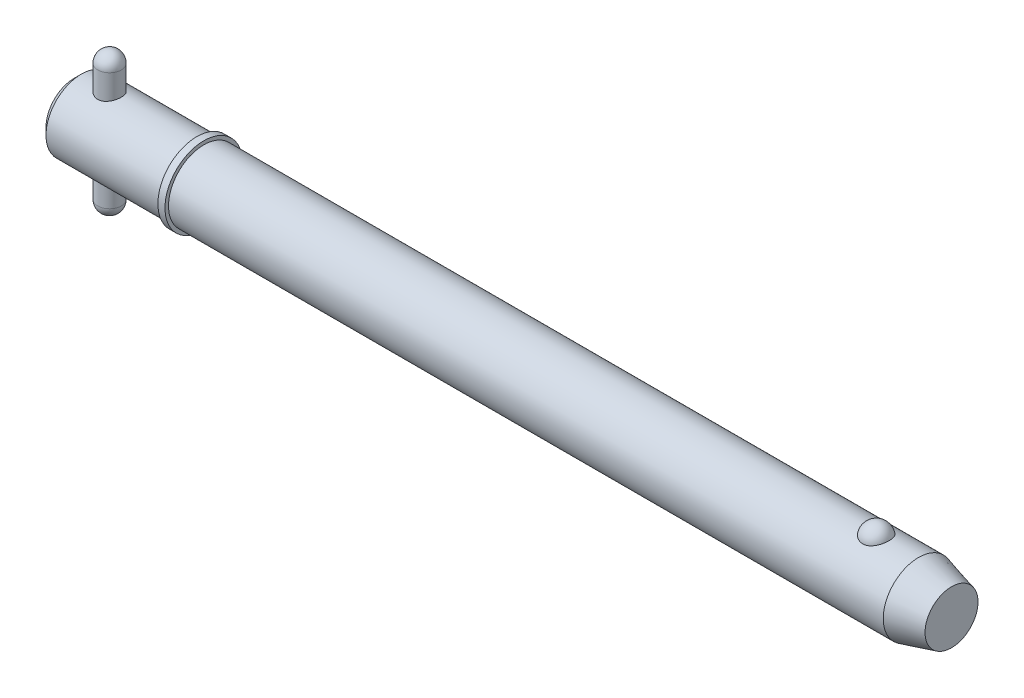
ISO-10303-21;
HEADER;
FILE_DESCRIPTION(('STEP AP214'),'2;1');
FILE_NAME('part.step','',(''),(''),'','','');
FILE_SCHEMA(('AUTOMOTIVE_DESIGN { 1 0 10303 214 1 1 1 1 }'));
ENDSEC;
DATA;
#1=APPLICATION_CONTEXT('core data for automotive mechanical design processes');
#2=APPLICATION_PROTOCOL_DEFINITION('international standard','automotive_design',2000,#1);
#3=PRODUCT_CONTEXT('',#1,'mechanical');
#4=PRODUCT('Part','Part','',(#3));
#5=PRODUCT_RELATED_PRODUCT_CATEGORY('part','',(#4));
#6=PRODUCT_DEFINITION_FORMATION('','',#4);
#7=PRODUCT_DEFINITION_CONTEXT('part definition',#1,'design');
#8=PRODUCT_DEFINITION('design','',#6,#7);
#9=PRODUCT_DEFINITION_SHAPE('','',#8);
#10=(LENGTH_UNIT() NAMED_UNIT(*) SI_UNIT(.MILLI.,.METRE.));
#11=(NAMED_UNIT(*) PLANE_ANGLE_UNIT() SI_UNIT($,.RADIAN.));
#12=(NAMED_UNIT(*) SI_UNIT($,.STERADIAN.) SOLID_ANGLE_UNIT());
#13=UNCERTAINTY_MEASURE_WITH_UNIT(LENGTH_MEASURE(1.E-05),#10,'distance_accuracy_value','');
#14=(GEOMETRIC_REPRESENTATION_CONTEXT(3) GLOBAL_UNCERTAINTY_ASSIGNED_CONTEXT((#13)) GLOBAL_UNIT_ASSIGNED_CONTEXT((#10,
#11,#12)) REPRESENTATION_CONTEXT('',''));
#15=CARTESIAN_POINT('',(0.,0.,0.));
#16=DIRECTION('',(0.,0.,1.));
#17=DIRECTION('',(1.,0.,0.));
#18=AXIS2_PLACEMENT_3D('',#15,#16,#17);
#19=CARTESIAN_POINT('',(9.525,19.05,0.));
#20=DIRECTION('',(0.,-1.,0.));
#21=DIRECTION('',(0.,0.,-1.));
#22=AXIS2_PLACEMENT_3D('',#19,#20,#21);
#23=CYLINDRICAL_SURFACE('',#22,3.175);
#24=CARTESIAN_POINT('',(9.525,-15.875,0.));
#25=DIRECTION('',(0.,-1.,0.));
#26=DIRECTION('',(0.,0.,-1.));
#27=AXIS2_PLACEMENT_3D('',#24,#25,#26);
#28=CIRCLE('',#27,3.175);
#29=CARTESIAN_POINT('',(9.525,-15.875,-3.175));
#30=VERTEX_POINT('',#29);
#31=EDGE_CURVE('P0_E10',#30,#30,#28,.F.);
#32=CARTESIAN_POINT('',(9.525,15.875,0.));
#33=DIRECTION('',(0.,-1.,0.));
#34=DIRECTION('',(0.,0.,-1.));
#35=AXIS2_PLACEMENT_3D('',#32,#33,#34);
#36=CIRCLE('',#35,3.175);
#37=CARTESIAN_POINT('',(9.525,15.875,-3.175));
#38=VERTEX_POINT('',#37);
#39=EDGE_CURVE('P0_E21',#38,#38,#36,.T.);
#40=CARTESIAN_POINT('',(9.525,-15.875,-3.175));
#41=CARTESIAN_POINT('',(9.525,-15.5442708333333,-3.175));
#42=CARTESIAN_POINT('',(9.525,-15.2135416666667,-3.175));
#43=CARTESIAN_POINT('',(9.525,-14.5520833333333,-3.175));
#44=CARTESIAN_POINT('',(9.525,-14.2213541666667,-3.175));
#45=CARTESIAN_POINT('',(9.525,-13.5598958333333,-3.175));
#46=CARTESIAN_POINT('',(9.525,-13.2291666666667,-3.175));
#47=CARTESIAN_POINT('',(9.525,-12.5677083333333,-3.175));
#48=CARTESIAN_POINT('',(9.525,-12.2369791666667,-3.175));
#49=CARTESIAN_POINT('',(9.525,-11.5755208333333,-3.175));
#50=CARTESIAN_POINT('',(9.525,-11.2447916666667,-3.175));
#51=CARTESIAN_POINT('',(9.525,-10.5833333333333,-3.175));
#52=CARTESIAN_POINT('',(9.525,-10.2526041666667,-3.175));
#53=CARTESIAN_POINT('',(9.525,-9.59114583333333,-3.175));
#54=CARTESIAN_POINT('',(9.525,-9.26041666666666,-3.175));
#55=CARTESIAN_POINT('',(9.525,-8.59895833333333,-3.175));
#56=CARTESIAN_POINT('',(9.525,-8.26822916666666,-3.175));
#57=CARTESIAN_POINT('',(9.525,-7.60677083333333,-3.175));
#58=CARTESIAN_POINT('',(9.525,-7.27604166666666,-3.175));
#59=CARTESIAN_POINT('',(9.525,-6.61458333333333,-3.175));
#60=CARTESIAN_POINT('',(9.525,-6.28385416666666,-3.175));
#61=CARTESIAN_POINT('',(9.525,-5.62239583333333,-3.175));
#62=CARTESIAN_POINT('',(9.525,-5.29166666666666,-3.175));
#63=CARTESIAN_POINT('',(9.525,-4.63020833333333,-3.175));
#64=CARTESIAN_POINT('',(9.525,-4.29947916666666,-3.175));
#65=CARTESIAN_POINT('',(9.525,-3.63802083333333,-3.175));
#66=CARTESIAN_POINT('',(9.525,-3.30729166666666,-3.175));
#67=CARTESIAN_POINT('',(9.525,-2.64583333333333,-3.175));
#68=CARTESIAN_POINT('',(9.525,-2.31510416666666,-3.175));
#69=CARTESIAN_POINT('',(9.525,-1.65364583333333,-3.175));
#70=CARTESIAN_POINT('',(9.525,-1.32291666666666,-3.175));
#71=CARTESIAN_POINT('',(9.525,-0.661458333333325,-3.175));
#72=CARTESIAN_POINT('',(9.525,-0.330729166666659,-3.175));
#73=CARTESIAN_POINT('',(9.525,0.330729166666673,-3.175));
#74=CARTESIAN_POINT('',(9.525,0.661458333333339,-3.175));
#75=CARTESIAN_POINT('',(9.525,1.32291666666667,-3.175));
#76=CARTESIAN_POINT('',(9.525,1.65364583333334,-3.175));
#77=CARTESIAN_POINT('',(9.525,2.31510416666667,-3.175));
#78=CARTESIAN_POINT('',(9.525,2.64583333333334,-3.175));
#79=CARTESIAN_POINT('',(9.525,3.30729166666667,-3.175));
#80=CARTESIAN_POINT('',(9.525,3.63802083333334,-3.175));
#81=CARTESIAN_POINT('',(9.525,4.29947916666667,-3.175));
#82=CARTESIAN_POINT('',(9.525,4.63020833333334,-3.175));
#83=CARTESIAN_POINT('',(9.525,5.29166666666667,-3.175));
#84=CARTESIAN_POINT('',(9.525,5.62239583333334,-3.175));
#85=CARTESIAN_POINT('',(9.525,6.28385416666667,-3.175));
#86=CARTESIAN_POINT('',(9.525,6.61458333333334,-3.175));
#87=CARTESIAN_POINT('',(9.525,7.27604166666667,-3.175));
#88=CARTESIAN_POINT('',(9.525,7.60677083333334,-3.175));
#89=CARTESIAN_POINT('',(9.525,8.26822916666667,-3.175));
#90=CARTESIAN_POINT('',(9.525,8.59895833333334,-3.175));
#91=CARTESIAN_POINT('',(9.525,9.26041666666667,-3.175));
#92=CARTESIAN_POINT('',(9.525,9.59114583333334,-3.175));
#93=CARTESIAN_POINT('',(9.525,10.2526041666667,-3.175));
#94=CARTESIAN_POINT('',(9.525,10.5833333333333,-3.175));
#95=CARTESIAN_POINT('',(9.525,11.2447916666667,-3.175));
#96=CARTESIAN_POINT('',(9.525,11.5755208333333,-3.175));
#97=CARTESIAN_POINT('',(9.525,12.2369791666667,-3.175));
#98=CARTESIAN_POINT('',(9.525,12.5677083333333,-3.175));
#99=CARTESIAN_POINT('',(9.525,13.2291666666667,-3.175));
#100=CARTESIAN_POINT('',(9.525,13.5598958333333,-3.175));
#101=CARTESIAN_POINT('',(9.525,14.2213541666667,-3.175));
#102=CARTESIAN_POINT('',(9.525,14.5520833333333,-3.175));
#103=CARTESIAN_POINT('',(9.525,15.2135416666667,-3.175));
#104=CARTESIAN_POINT('',(9.525,15.5442708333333,-3.175));
#105=CARTESIAN_POINT('',(9.525,15.875,-3.175));
#106=B_SPLINE_CURVE_WITH_KNOTS('',3,(#40,#41,#42,#43,#44,#45,#46,#47,#48,#49,#50,#51,#52,#53,
#54,#55,#56,#57,#58,#59,#60,#61,#62,#63,#64,#65,#66,#67,#68,#69,#70,#71,#72,#73,#74,#75,#76,#77,
#78,#79,#80,#81,#82,#83,#84,#85,#86,#87,#88,#89,#90,#91,#92,#93,#94,#95,#96,#97,#98,#99,#100,
#101,#102,#103,#104,#105),.UNSPECIFIED.,.F.,.F.,(4,2,2,2,2,2,2,2,2,2,2,2,2,2,2,2,2,2,2,2,2,2,2,
2,2,2,2,2,2,2,2,2,4),(0.,0.992187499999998,1.984375,2.9765625,3.96875,4.96093749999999,5.953125,
6.9453125,7.9375,8.92968749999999,9.921875,10.9140625,11.90625,12.8984375,13.890625,14.8828125,
15.875,16.8671875,17.859375,18.8515625,19.84375,20.8359375,21.828125,22.8203125,23.8125,
24.8046875,25.796875,26.7890625,27.78125,28.7734375,29.765625,30.7578125,31.75),.UNSPECIFIED.);
#107=EDGE_CURVE('P0_BSEAM14',#30,#38,#106,.T.);
#108=ORIENTED_EDGE('',*,*,#31,.T.);
#109=ORIENTED_EDGE('',*,*,#39,.T.);
#110=ORIENTED_EDGE('',*,*,#107,.T.);
#111=ORIENTED_EDGE('',*,*,#107,.F.);
#112=EDGE_LOOP('',(#108,#110,#109,#111));
#113=FACE_BOUND('',#112,.T.);
#114=ADVANCED_FACE('P0_F14',(#113),#23,.T.);
#115=CARTESIAN_POINT('',(9.525,-15.875,0.));
#116=DIRECTION('',(0.,0.,1.));
#117=DIRECTION('',(1.,0.,0.));
#118=AXIS2_PLACEMENT_3D('',#115,#116,#117);
#119=SPHERICAL_SURFACE('',#118,3.175);
#120=CARTESIAN_POINT('',(9.525,-15.875,0.));
#121=DIRECTION('',(0.,-1.,0.));
#122=DIRECTION('',(0.,0.,-1.));
#123=AXIS2_PLACEMENT_3D('',#120,#121,#122);
#124=SPHERICAL_SURFACE('',#123,3.175);
#125=ORIENTED_EDGE('',*,*,#31,.F.);
#126=EDGE_LOOP('',(#125));
#127=FACE_BOUND('',#126,.T.);
#128=ADVANCED_FACE('P0_F29',(#127),#124,.T.);
#129=CARTESIAN_POINT('',(9.525,15.875,0.));
#130=DIRECTION('',(0.,0.,1.));
#131=DIRECTION('',(1.,0.,0.));
#132=AXIS2_PLACEMENT_3D('',#129,#130,#131);
#133=SPHERICAL_SURFACE('',#132,3.175);
#134=CARTESIAN_POINT('',(9.525,15.875,0.));
#135=DIRECTION('',(0.,-1.,0.));
#136=DIRECTION('',(0.,0.,-1.));
#137=AXIS2_PLACEMENT_3D('',#134,#135,#136);
#138=SPHERICAL_SURFACE('',#137,3.175);
#139=ORIENTED_EDGE('',*,*,#39,.F.);
#140=EDGE_LOOP('',(#139));
#141=FACE_BOUND('',#140,.T.);
#142=ADVANCED_FACE('P0_F16',(#141),#138,.T.);
#143=CLOSED_SHELL('',(#114,#128,#142));
#144=MANIFOLD_SOLID_BREP('P0_B1',#143);
#145=CARTESIAN_POINT('',(0.,0.,0.));
#146=DIRECTION('',(1.,0.,0.));
#147=DIRECTION('',(0.,0.,-1.));
#148=AXIS2_PLACEMENT_3D('',#145,#146,#147);
#149=CYLINDRICAL_SURFACE('',#148,9.525);
#150=CARTESIAN_POINT('',(227.643054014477,0.,0.));
#151=DIRECTION('',(1.,0.,0.));
#152=DIRECTION('',(0.,0.,-1.));
#153=AXIS2_PLACEMENT_3D('',#150,#151,#152);
#154=CIRCLE('',#153,9.525);
#155=CARTESIAN_POINT('',(227.643054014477,0.,-9.525));
#156=VERTEX_POINT('',#155);
#157=EDGE_CURVE('P1_E81',#156,#156,#154,.T.);
#158=ORIENTED_EDGE('',*,*,#157,.F.);
#159=EDGE_LOOP('',(#158));
#160=FACE_BOUND('',#159,.T.);
#161=CARTESIAN_POINT('',(34.93,0.,0.));
#162=DIRECTION('',(1.,0.,0.));
#163=DIRECTION('',(0.,0.,-1.));
#164=AXIS2_PLACEMENT_3D('',#161,#162,#163);
#165=CIRCLE('',#164,9.525);
#166=CARTESIAN_POINT('',(34.93,0.,-9.525));
#167=VERTEX_POINT('',#166);
#168=EDGE_CURVE('P1_E85',#167,#167,#165,.T.);
#169=ORIENTED_EDGE('',*,*,#168,.T.);
#170=EDGE_LOOP('',(#169));
#171=FACE_BOUND('',#170,.T.);
#172=CARTESIAN_POINT('',(216.245757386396,8.80405803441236,3.63513233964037));
#173=CARTESIAN_POINT('',(216.151676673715,8.80405953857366,3.63513053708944));
#174=CARTESIAN_POINT('',(216.057561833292,8.80561325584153,3.63137461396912));
#175=CARTESIAN_POINT('',(215.870012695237,8.81177748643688,3.616386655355));
#176=CARTESIAN_POINT('',(215.776578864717,8.81638992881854,3.60514990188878));
#177=CARTESIAN_POINT('',(215.497945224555,8.83467114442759,3.56024627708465));
#178=CARTESIAN_POINT('',(215.314691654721,8.85278327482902,3.51538626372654));
#179=CARTESIAN_POINT('',(214.959509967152,8.89871214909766,3.39742145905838));
#180=CARTESIAN_POINT('',(214.787553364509,8.9265032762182,3.32439116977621));
#181=CARTESIAN_POINT('',(214.458707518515,8.98874819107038,3.15220244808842));
#182=CARTESIAN_POINT('',(214.301811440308,9.02319893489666,3.053055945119));
#183=CARTESIAN_POINT('',(214.002214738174,9.0962918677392,2.82797815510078));
#184=CARTESIAN_POINT('',(213.860060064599,9.13502685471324,2.70135138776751));
#185=CARTESIAN_POINT('',(213.598299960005,9.21186572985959,2.42641932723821));
#186=CARTESIAN_POINT('',(213.478701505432,9.2499694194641,2.27810735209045));
#187=CARTESIAN_POINT('',(213.259645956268,9.3234108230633,1.95652290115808));
#188=CARTESIAN_POINT('',(213.161317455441,9.35855090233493,1.78243511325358));
#189=CARTESIAN_POINT('',(212.993819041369,9.42045142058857,1.41937246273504));
#190=CARTESIAN_POINT('',(212.924651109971,9.44721128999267,1.23039658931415));
#191=CARTESIAN_POINT('',(212.816199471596,9.48990641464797,0.840370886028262));
#192=CARTESIAN_POINT('',(212.777288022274,9.50570658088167,0.639202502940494));
#193=CARTESIAN_POINT('',(212.731555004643,9.52433146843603,0.232664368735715));
#194=CARTESIAN_POINT('',(212.724732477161,9.52715657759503,0.0272947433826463));
#195=CARTESIAN_POINT('',(212.743255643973,9.51956918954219,-0.380478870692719));
#196=CARTESIAN_POINT('',(212.768405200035,9.50923740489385,-0.582893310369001));
#197=CARTESIAN_POINT('',(212.85002537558,9.47651897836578,-0.980293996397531));
#198=CARTESIAN_POINT('',(212.906496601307,9.45413210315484,-1.17528009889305));
#199=CARTESIAN_POINT('',(213.049719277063,9.39954044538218,-1.55263697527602));
#200=CARTESIAN_POINT('',(213.136512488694,9.36732213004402,-1.73498993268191));
#201=CARTESIAN_POINT('',(213.338610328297,9.29640700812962,-2.08177763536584));
#202=CARTESIAN_POINT('',(213.453917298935,9.25770966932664,-2.24621090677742));
#203=CARTESIAN_POINT('',(213.711264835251,9.17775604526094,-2.5533833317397));
#204=CARTESIAN_POINT('',(213.853434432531,9.136488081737,-2.69601150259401));
#205=CARTESIAN_POINT('',(214.16089985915,9.05620497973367,-2.95451229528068));
#206=CARTESIAN_POINT('',(214.326193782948,9.01718965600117,-3.07038711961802));
#207=CARTESIAN_POINT('',(214.672052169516,8.9468001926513,-3.26976836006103));
#208=CARTESIAN_POINT('',(214.852227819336,8.91528408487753,-3.35389750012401));
#209=CARTESIAN_POINT('',(215.225651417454,8.86272514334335,-3.49043503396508));
#210=CARTESIAN_POINT('',(215.418894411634,8.8416783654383,-3.54285537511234));
#211=CARTESIAN_POINT('',(215.802503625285,8.81348056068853,-3.61241306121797));
#212=CARTESIAN_POINT('',(215.992525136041,8.80568348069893,-3.63119339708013));
#213=CARTESIAN_POINT('',(216.373190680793,8.80289410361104,-3.6379534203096));
#214=CARTESIAN_POINT('',(216.563834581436,8.8078992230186,-3.6259393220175));
#215=CARTESIAN_POINT('',(216.934007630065,8.82974915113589,-3.57238430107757));
#216=CARTESIAN_POINT('',(217.113697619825,8.84621463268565,-3.53178890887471));
#217=CARTESIAN_POINT('',(217.463422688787,8.88875330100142,-3.42331083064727));
#218=CARTESIAN_POINT('',(217.633456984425,8.91482726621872,-3.35542593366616));
#219=CARTESIAN_POINT('',(217.963237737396,8.97448239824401,-3.19248225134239));
#220=CARTESIAN_POINT('',(218.122680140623,9.00821446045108,-3.09686474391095));
#221=CARTESIAN_POINT('',(218.423513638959,9.0793539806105,-2.88162736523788));
#222=CARTESIAN_POINT('',(218.564900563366,9.1167622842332,-2.7620019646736));
#223=CARTESIAN_POINT('',(218.83331931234,9.19347419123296,-2.49516285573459));
#224=CARTESIAN_POINT('',(218.959275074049,9.23277872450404,-2.34686614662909));
#225=CARTESIAN_POINT('',(219.185522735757,9.30737610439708,-2.03093683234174));
#226=CARTESIAN_POINT('',(219.28581004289,9.34266823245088,-1.86330077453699));
#227=CARTESIAN_POINT('',(219.461514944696,9.40674710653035,-1.50744893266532));
#228=CARTESIAN_POINT('',(219.536041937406,9.4352917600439,-1.31874876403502));
#229=CARTESIAN_POINT('',(219.65416505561,9.4814413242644,-0.930631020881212));
#230=CARTESIAN_POINT('',(219.697760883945,9.49904612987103,-0.73121334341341));
#231=CARTESIAN_POINT('',(219.753158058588,9.5215314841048,-0.327147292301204));
#232=CARTESIAN_POINT('',(219.764935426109,9.52640243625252,-0.122495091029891));
#233=CARTESIAN_POINT('',(219.756382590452,9.52289571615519,0.286018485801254));
#234=CARTESIAN_POINT('',(219.73605305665,9.51451832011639,0.489879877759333));
#235=CARTESIAN_POINT('',(219.663884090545,9.48544083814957,0.889994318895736));
#236=CARTESIAN_POINT('',(219.612199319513,9.46480124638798,1.08627971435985));
#237=CARTESIAN_POINT('',(219.478491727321,9.4133389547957,1.46682086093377));
#238=CARTESIAN_POINT('',(219.396466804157,9.38251554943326,1.65107577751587));
#239=CARTESIAN_POINT('',(219.20319292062,9.31365636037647,2.00346348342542));
#240=CARTESIAN_POINT('',(219.091783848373,9.27558138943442,2.17150083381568));
#241=CARTESIAN_POINT('',(218.842294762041,9.19638714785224,2.48563115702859));
#242=CARTESIAN_POINT('',(218.704216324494,9.15526805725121,2.63172542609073));
#243=CARTESIAN_POINT('',(218.404843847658,9.07465393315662,2.89750997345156));
#244=CARTESIAN_POINT('',(218.243610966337,9.03515496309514,3.01726776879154));
#245=CARTESIAN_POINT('',(217.901613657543,8.96227564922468,3.22732920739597));
#246=CARTESIAN_POINT('',(217.720841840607,8.92889763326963,3.31762165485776));
#247=CARTESIAN_POINT('',(217.351445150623,8.87345380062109,3.46314419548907));
#248=CARTESIAN_POINT('',(217.16332371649,8.85102983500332,3.51950082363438));
#249=CARTESIAN_POINT('',(216.87578699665,8.82666967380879,3.57993683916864));
#250=CARTESIAN_POINT('',(216.779133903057,8.82009725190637,3.59606217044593));
#251=CARTESIAN_POINT('',(216.584677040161,8.81020897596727,3.62022512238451));
#252=CARTESIAN_POINT('',(216.48687410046,8.80689090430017,3.62826825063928));
#253=CARTESIAN_POINT('',(216.341224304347,8.80445615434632,3.63416760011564));
#254=CARTESIAN_POINT('',(216.293495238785,8.80405727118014,3.63513325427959));
#255=CARTESIAN_POINT('',(216.245757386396,8.80405803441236,3.63513233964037));
#256=B_SPLINE_CURVE_WITH_KNOTS('',3,(#172,#173,#174,#175,#176,#177,#178,#179,#180,#181,#182,
#183,#184,#185,#186,#187,#188,#189,#190,#191,#192,#193,#194,#195,#196,#197,#198,#199,#200,#201,
#202,#203,#204,#205,#206,#207,#208,#209,#210,#211,#212,#213,#214,#215,#216,#217,#218,#219,#220,
#221,#222,#223,#224,#225,#226,#227,#228,#229,#230,#231,#232,#233,#234,#235,#236,#237,#238,#239,
#240,#241,#242,#243,#244,#245,#246,#247,#248,#249,#250,#251,#252,#253,#254,#255),.UNSPECIFIED.,
.T.,.F.,(4,2,2,2,2,2,2,2,2,2,2,2,2,2,2,2,2,2,2,2,2,2,2,2,2,2,2,2,2,2,2,2,2,2,2,2,2,2,2,2,2,4),
(0.,0.282202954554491,0.564584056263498,1.13017050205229,1.69427128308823,2.25811483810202,
2.83836627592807,3.41879688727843,4.02497117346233,4.63118665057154,5.24474754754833,
5.85829010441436,6.46808687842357,7.07789545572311,7.68854723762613,8.29924920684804,
8.91296283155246,9.52662591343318,10.1275338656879,10.7282152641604,11.2986646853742,
11.868998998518,12.4213015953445,12.9736489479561,13.5380053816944,14.1024919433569,
14.6952986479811,15.2882113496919,15.8999469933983,16.5116885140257,17.1238909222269,
17.7360805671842,18.3452748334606,18.9545113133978,19.5671386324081,20.1797297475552,
20.7907316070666,21.4019653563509,21.9915938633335,22.2859053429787,22.580016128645,
22.7232098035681),.UNSPECIFIED.);
#257=CARTESIAN_POINT('',(216.245757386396,8.80405803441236,3.63513233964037));
#258=VERTEX_POINT('',#257);
#259=EDGE_CURVE('P1_E35',#258,#258,#256,.T.);
#260=ORIENTED_EDGE('',*,*,#259,.T.);
#261=EDGE_LOOP('',(#260));
#262=FACE_BOUND('',#261,.T.);
#263=ADVANCED_FACE('P1_F13',(#160,#171,#262),#149,.T.);
#264=CARTESIAN_POINT('',(0.,0.,0.));
#265=DIRECTION('',(-1.,0.,0.));
#266=DIRECTION('',(0.,0.,1.));
#267=AXIS2_PLACEMENT_3D('',#264,#265,#266);
#268=PLANE('',#267);
#269=CARTESIAN_POINT('',(0.,0.,0.));
#270=DIRECTION('',(1.,0.,0.));
#271=DIRECTION('',(0.,0.,-1.));
#272=AXIS2_PLACEMENT_3D('',#269,#270,#271);
#273=CIRCLE('',#272,7.62);
#274=CARTESIAN_POINT('',(0.,0.,-7.62));
#275=VERTEX_POINT('',#274);
#276=EDGE_CURVE('P1_E9',#275,#275,#273,.T.);
#277=ORIENTED_EDGE('',*,*,#276,.F.);
#278=EDGE_LOOP('',(#277));
#279=FACE_BOUND('',#278,.T.);
#280=ADVANCED_FACE('P1_F15',(#279),#268,.T.);
#281=CARTESIAN_POINT('',(1.90499999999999,0.,0.));
#282=DIRECTION('',(1.,0.,0.));
#283=DIRECTION('',(0.,0.,-1.));
#284=AXIS2_PLACEMENT_3D('',#281,#282,#283);
#285=CONICAL_SURFACE('',#284,9.525,0.785398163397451);
#286=ORIENTED_EDGE('',*,*,#276,.T.);
#287=EDGE_LOOP('',(#286));
#288=FACE_BOUND('',#287,.T.);
#289=CARTESIAN_POINT('',(1.90499999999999,0.,0.));
#290=DIRECTION('',(1.,0.,0.));
#291=DIRECTION('',(0.,0.,-1.));
#292=AXIS2_PLACEMENT_3D('',#289,#290,#291);
#293=CIRCLE('',#292,9.525);
#294=CARTESIAN_POINT('',(1.90499999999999,0.,-9.525));
#295=VERTEX_POINT('',#294);
#296=EDGE_CURVE('P1_E26',#295,#295,#293,.T.);
#297=ORIENTED_EDGE('',*,*,#296,.F.);
#298=EDGE_LOOP('',(#297));
#299=FACE_BOUND('',#298,.T.);
#300=ADVANCED_FACE('P1_F77',(#288,#299),#285,.T.);
#301=CARTESIAN_POINT('',(0.,0.,0.));
#302=DIRECTION('',(1.,0.,0.));
#303=DIRECTION('',(0.,0.,-1.));
#304=AXIS2_PLACEMENT_3D('',#301,#302,#303);
#305=CYLINDRICAL_SURFACE('',#304,9.525);
#306=CARTESIAN_POINT('',(9.525,-8.98025612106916,3.175));
#307=CARTESIAN_POINT('',(9.35206354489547,-8.98025555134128,3.17500081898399));
#308=CARTESIAN_POINT('',(9.17913201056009,-8.98530617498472,3.16082293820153));
#309=CARTESIAN_POINT('',(8.83839221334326,-9.00485797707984,3.10467734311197));
#310=CARTESIAN_POINT('',(8.67058479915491,-9.0193607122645,3.06270505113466));
#311=CARTESIAN_POINT('',(8.34508461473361,-9.05599546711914,2.95260866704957));
#312=CARTESIAN_POINT('',(8.18737272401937,-9.07811252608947,2.88453582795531));
#313=CARTESIAN_POINT('',(7.88555684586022,-9.12746212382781,2.72434567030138));
#314=CARTESIAN_POINT('',(7.74145587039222,-9.1546957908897,2.63222304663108));
#315=CARTESIAN_POINT('',(7.46531411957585,-9.21240503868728,2.42268738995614));
#316=CARTESIAN_POINT('',(7.33388351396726,-9.24296141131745,2.30449228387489));
#317=CARTESIAN_POINT('',(7.09229340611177,-9.30319020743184,2.0478358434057));
#318=CARTESIAN_POINT('',(6.98213731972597,-9.33286248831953,1.90937126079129));
#319=CARTESIAN_POINT('',(6.78345450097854,-9.38891527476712,1.61164431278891));
#320=CARTESIAN_POINT('',(6.69556709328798,-9.41518969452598,1.45193356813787));
#321=CARTESIAN_POINT('',(6.54814671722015,-9.46053437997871,1.11896913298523));
#322=CARTESIAN_POINT('',(6.48860610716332,-9.47960658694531,0.945719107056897));
#323=CARTESIAN_POINT('',(6.40163866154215,-9.50782564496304,0.596991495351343));
#324=CARTESIAN_POINT('',(6.373166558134,-9.5172947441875,0.421801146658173));
#325=CARTESIAN_POINT('',(6.3458207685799,-9.52638456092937,0.068890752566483));
#326=CARTESIAN_POINT('',(6.34693945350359,-9.52600781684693,-0.108828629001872));
#327=CARTESIAN_POINT('',(6.37808050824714,-9.51566675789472,-0.454353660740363));
#328=CARTESIAN_POINT('',(6.4069675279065,-9.50607905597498,-0.622274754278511));
#329=CARTESIAN_POINT('',(6.490947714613,-9.47886621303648,-0.950732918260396));
#330=CARTESIAN_POINT('',(6.54604265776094,-9.46124052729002,-1.11126948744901));
#331=CARTESIAN_POINT('',(6.68153768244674,-9.41945253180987,-1.42288410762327));
#332=CARTESIAN_POINT('',(6.76226085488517,-9.3952073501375,-1.57381010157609));
#333=CARTESIAN_POINT('',(6.94645456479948,-9.34270397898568,-1.86030973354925));
#334=CARTESIAN_POINT('',(7.04993142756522,-9.31444467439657,-1.99587908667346));
#335=CARTESIAN_POINT('',(7.28241619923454,-9.25532159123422,-2.2545702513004));
#336=CARTESIAN_POINT('',(7.4123967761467,-9.22439783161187,-2.37680549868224));
#337=CARTESIAN_POINT('',(7.69127470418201,-9.1645528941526,-2.5980302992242));
#338=CARTESIAN_POINT('',(7.84017496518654,-9.13563202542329,-2.6970162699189));
#339=CARTESIAN_POINT('',(8.15547526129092,-9.08273917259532,-2.87016016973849));
#340=CARTESIAN_POINT('',(8.32209451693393,-9.05884361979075,-2.94394402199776));
#341=CARTESIAN_POINT('',(8.66638917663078,-9.01959241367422,-3.06210713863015));
#342=CARTESIAN_POINT('',(8.84405991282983,-9.00423318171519,-3.10649872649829));
#343=CARTESIAN_POINT('',(9.19682677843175,-8.98460345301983,-3.16281207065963));
#344=CARTESIAN_POINT('',(9.37167742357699,-8.9798639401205,-3.17610837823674));
#345=CARTESIAN_POINT('',(9.72113927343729,-8.9806993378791,-3.17374726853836));
#346=CARTESIAN_POINT('',(9.89575051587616,-8.98627237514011,-3.15809511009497));
#347=CARTESIAN_POINT('',(10.2335233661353,-9.00663737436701,-3.09951644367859));
#348=CARTESIAN_POINT('',(10.3968722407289,-9.02110608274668,-3.05754530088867));
#349=CARTESIAN_POINT('',(10.7141759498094,-9.05727657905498,-2.94866651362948));
#350=CARTESIAN_POINT('',(10.8681291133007,-9.07897964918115,-2.88175444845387));
#351=CARTESIAN_POINT('',(11.1676828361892,-9.12802586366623,-2.72248103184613));
#352=CARTESIAN_POINT('',(11.3128635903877,-9.1555260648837,-2.62937980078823));
#353=CARTESIAN_POINT('',(11.5860387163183,-9.21276315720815,-2.42120937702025));
#354=CARTESIAN_POINT('',(11.7140280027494,-9.24250070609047,-2.30613370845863));
#355=CARTESIAN_POINT('',(11.9555513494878,-9.30259247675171,-2.05070616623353));
#356=CARTESIAN_POINT('',(12.0680936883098,-9.33290753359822,-1.90940458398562));
#357=CARTESIAN_POINT('',(12.267933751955,-9.3893275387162,-1.60917665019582));
#358=CARTESIAN_POINT('',(12.3552323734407,-9.41543263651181,-1.45025092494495));
#359=CARTESIAN_POINT('',(12.5013088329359,-9.46036988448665,-1.12007606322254));
#360=CARTESIAN_POINT('',(12.5602723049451,-9.47924920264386,-0.9489158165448));
#361=CARTESIAN_POINT('',(12.6483355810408,-9.50781089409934,-0.598355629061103));
#362=CARTESIAN_POINT('',(12.6774461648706,-9.5174965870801,-0.4189586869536));
#363=CARTESIAN_POINT('',(12.7040070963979,-9.52632915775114,-0.066088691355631));
#364=CARTESIAN_POINT('',(12.7028811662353,-9.52594996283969,0.107266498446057));
#365=CARTESIAN_POINT('',(12.6725130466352,-9.51586223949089,0.451202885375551));
#366=CARTESIAN_POINT('',(12.643273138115,-9.50615446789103,0.621784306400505));
#367=CARTESIAN_POINT('',(12.5584514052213,-9.47867404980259,0.952633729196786));
#368=CARTESIAN_POINT('',(12.5032953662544,-9.46103195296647,1.1130225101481));
#369=CARTESIAN_POINT('',(12.3686013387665,-9.41949985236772,1.42233126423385));
#370=CARTESIAN_POINT('',(12.2890589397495,-9.39560871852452,1.57124915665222));
#371=CARTESIAN_POINT('',(12.1044667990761,-9.34294133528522,1.85938800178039));
#372=CARTESIAN_POINT('',(11.9985831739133,-9.31401720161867,1.9980473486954));
#373=CARTESIAN_POINT('',(11.7657327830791,-9.25490239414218,2.25609475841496));
#374=CARTESIAN_POINT('',(11.6387592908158,-9.22471131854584,2.37547664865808));
#375=CARTESIAN_POINT('',(11.3613902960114,-9.16505913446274,2.59633024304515));
#376=CARTESIAN_POINT('',(11.2102725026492,-9.13567286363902,2.69691791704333));
#377=CARTESIAN_POINT('',(10.8923631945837,-9.08241113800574,2.87119803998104));
#378=CARTESIAN_POINT('',(10.7255757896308,-9.05853424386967,2.94489751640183));
#379=CARTESIAN_POINT('',(10.3887212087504,-9.02021736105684,3.06020415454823));
#380=CARTESIAN_POINT('',(10.219143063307,-9.00539959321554,3.10311136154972));
#381=CARTESIAN_POINT('',(9.87470703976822,-8.98542092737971,3.16050396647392));
#382=CARTESIAN_POINT('',(9.699851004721,-8.98025669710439,3.17499917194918));
#383=CARTESIAN_POINT('',(9.525,-8.98025612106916,3.175));
#384=B_SPLINE_CURVE_WITH_KNOTS('',3,(#306,#307,#308,#309,#310,#311,#312,#313,#314,#315,#316,
#317,#318,#319,#320,#321,#322,#323,#324,#325,#326,#327,#328,#329,#330,#331,#332,#333,#334,#335,
#336,#337,#338,#339,#340,#341,#342,#343,#344,#345,#346,#347,#348,#349,#350,#351,#352,#353,#354,
#355,#356,#357,#358,#359,#360,#361,#362,#363,#364,#365,#366,#367,#368,#369,#370,#371,#372,#373,
#374,#375,#376,#377,#378,#379,#380,#381,#382,#383),.UNSPECIFIED.,.T.,.F.,(4,2,2,2,2,2,2,2,2,2,2,
2,2,2,2,2,2,2,2,2,2,2,2,2,2,2,2,2,2,2,2,2,2,2,2,2,2,2,4),(0.,0.518161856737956,1.03640907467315,
1.55364379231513,2.07099270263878,2.60671746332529,3.14252816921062,3.69231882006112,
4.24196117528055,4.77247962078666,5.30286129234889,5.81244090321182,6.32205505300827,
6.83836754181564,7.3548237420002,7.89559553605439,8.43645060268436,8.98501631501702,
9.53335188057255,10.056948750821,10.5804505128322,11.0859695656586,11.5915782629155,
12.1132237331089,12.6350231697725,13.1819271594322,13.7288117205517,14.2720628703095,
14.815117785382,15.3326491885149,15.8501386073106,16.3594083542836,16.868770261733,
17.3969527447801,17.925304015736,18.4743376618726,19.023227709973,19.5473069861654,
20.0712053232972),.UNSPECIFIED.);
#385=CARTESIAN_POINT('',(9.525,-8.98025612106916,3.175));
#386=VERTEX_POINT('',#385);
#387=EDGE_CURVE('P1_E17',#386,#386,#384,.T.);
#388=ORIENTED_EDGE('',*,*,#387,.F.);
#389=EDGE_LOOP('',(#388));
#390=FACE_BOUND('',#389,.T.);
#391=CARTESIAN_POINT('',(9.525,8.98025612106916,3.175));
#392=CARTESIAN_POINT('',(9.69793645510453,8.98025555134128,3.17500081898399));
#393=CARTESIAN_POINT('',(9.87086798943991,8.98530617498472,3.16082293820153));
#394=CARTESIAN_POINT('',(10.2116077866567,9.00485797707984,3.10467734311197));
#395=CARTESIAN_POINT('',(10.3794152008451,9.0193607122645,3.06270505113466));
#396=CARTESIAN_POINT('',(10.7049153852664,9.05599546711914,2.95260866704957));
#397=CARTESIAN_POINT('',(10.8626272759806,9.07811252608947,2.88453582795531));
#398=CARTESIAN_POINT('',(11.1644431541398,9.12746212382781,2.72434567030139));
#399=CARTESIAN_POINT('',(11.3085441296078,9.15469579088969,2.63222304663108));
#400=CARTESIAN_POINT('',(11.5846858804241,9.21240503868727,2.42268738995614));
#401=CARTESIAN_POINT('',(11.7161164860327,9.24296141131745,2.30449228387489));
#402=CARTESIAN_POINT('',(11.9577065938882,9.30319020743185,2.0478358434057));
#403=CARTESIAN_POINT('',(12.067862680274,9.33286248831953,1.90937126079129));
#404=CARTESIAN_POINT('',(12.2665454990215,9.38891527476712,1.61164431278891));
#405=CARTESIAN_POINT('',(12.354432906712,9.41518969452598,1.45193356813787));
#406=CARTESIAN_POINT('',(12.5018532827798,9.46053437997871,1.11896913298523));
#407=CARTESIAN_POINT('',(12.5613938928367,9.47960658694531,0.945719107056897));
#408=CARTESIAN_POINT('',(12.6483613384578,9.50782564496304,0.596991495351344));
#409=CARTESIAN_POINT('',(12.676833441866,9.5172947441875,0.421801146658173));
#410=CARTESIAN_POINT('',(12.7041792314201,9.52638456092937,0.0688907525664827));
#411=CARTESIAN_POINT('',(12.7030605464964,9.52600781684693,-0.108828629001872));
#412=CARTESIAN_POINT('',(12.6719194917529,9.51566675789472,-0.454353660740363));
#413=CARTESIAN_POINT('',(12.6430324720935,9.50607905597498,-0.622274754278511));
#414=CARTESIAN_POINT('',(12.559052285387,9.47886621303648,-0.950732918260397));
#415=CARTESIAN_POINT('',(12.5039573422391,9.46124052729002,-1.11126948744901));
#416=CARTESIAN_POINT('',(12.3684623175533,9.41945253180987,-1.42288410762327));
#417=CARTESIAN_POINT('',(12.2877391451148,9.3952073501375,-1.57381010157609));
#418=CARTESIAN_POINT('',(12.1035454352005,9.34270397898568,-1.86030973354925));
#419=CARTESIAN_POINT('',(12.0000685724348,9.31444467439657,-1.99587908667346));
#420=CARTESIAN_POINT('',(11.7675838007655,9.25532159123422,-2.2545702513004));
#421=CARTESIAN_POINT('',(11.6376032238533,9.22439783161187,-2.37680549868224));
#422=CARTESIAN_POINT('',(11.358725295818,9.1645528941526,-2.5980302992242));
#423=CARTESIAN_POINT('',(11.2098250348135,9.13563202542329,-2.6970162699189));
#424=CARTESIAN_POINT('',(10.8945247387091,9.08273917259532,-2.87016016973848));
#425=CARTESIAN_POINT('',(10.7279054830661,9.05884361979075,-2.94394402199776));
#426=CARTESIAN_POINT('',(10.3836108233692,9.01959241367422,-3.06210713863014));
#427=CARTESIAN_POINT('',(10.2059400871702,9.00423318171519,-3.10649872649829));
#428=CARTESIAN_POINT('',(9.85317322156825,8.98460345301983,-3.16281207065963));
#429=CARTESIAN_POINT('',(9.67832257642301,8.9798639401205,-3.17610837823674));
#430=CARTESIAN_POINT('',(9.32886072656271,8.9806993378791,-3.17374726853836));
#431=CARTESIAN_POINT('',(9.15424948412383,8.98627237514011,-3.15809511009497));
#432=CARTESIAN_POINT('',(8.81647663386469,9.00663737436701,-3.09951644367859));
#433=CARTESIAN_POINT('',(8.65312775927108,9.02110608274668,-3.05754530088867));
#434=CARTESIAN_POINT('',(8.33582405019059,9.05727657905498,-2.94866651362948));
#435=CARTESIAN_POINT('',(8.18187088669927,9.07897964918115,-2.88175444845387));
#436=CARTESIAN_POINT('',(7.88231716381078,9.12802586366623,-2.72248103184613));
#437=CARTESIAN_POINT('',(7.73713640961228,9.1555260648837,-2.62937980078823));
#438=CARTESIAN_POINT('',(7.46396128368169,9.21276315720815,-2.42120937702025));
#439=CARTESIAN_POINT('',(7.33597199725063,9.24250070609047,-2.30613370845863));
#440=CARTESIAN_POINT('',(7.09444865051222,9.30259247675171,-2.05070616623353));
#441=CARTESIAN_POINT('',(6.98190631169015,9.33290753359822,-1.90940458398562));
#442=CARTESIAN_POINT('',(6.78206624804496,9.3893275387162,-1.60917665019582));
#443=CARTESIAN_POINT('',(6.6947676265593,9.41543263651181,-1.45025092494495));
#444=CARTESIAN_POINT('',(6.54869116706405,9.46036988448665,-1.12007606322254));
#445=CARTESIAN_POINT('',(6.48972769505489,9.47924920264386,-0.948915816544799));
#446=CARTESIAN_POINT('',(6.40166441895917,9.50781089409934,-0.598355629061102));
#447=CARTESIAN_POINT('',(6.3725538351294,9.5174965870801,-0.418958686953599));
#448=CARTESIAN_POINT('',(6.34599290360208,9.52632915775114,-0.0660886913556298));
#449=CARTESIAN_POINT('',(6.3471188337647,9.52594996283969,0.107266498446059));
#450=CARTESIAN_POINT('',(6.37748695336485,9.51586223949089,0.451202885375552));
#451=CARTESIAN_POINT('',(6.40672686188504,9.50615446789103,0.621784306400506));
#452=CARTESIAN_POINT('',(6.49154859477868,9.47867404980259,0.952633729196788));
#453=CARTESIAN_POINT('',(6.54670463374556,9.46103195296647,1.11302251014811));
#454=CARTESIAN_POINT('',(6.68139866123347,9.41949985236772,1.42233126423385));
#455=CARTESIAN_POINT('',(6.76094106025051,9.39560871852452,1.57124915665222));
#456=CARTESIAN_POINT('',(6.94553320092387,9.34294133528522,1.85938800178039));
#457=CARTESIAN_POINT('',(7.05141682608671,9.31401720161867,1.9980473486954));
#458=CARTESIAN_POINT('',(7.28426721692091,9.25490239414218,2.25609475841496));
#459=CARTESIAN_POINT('',(7.41124070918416,9.22471131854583,2.37547664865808));
#460=CARTESIAN_POINT('',(7.68860970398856,9.16505913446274,2.59633024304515));
#461=CARTESIAN_POINT('',(7.83972749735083,9.13567286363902,2.69691791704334));
#462=CARTESIAN_POINT('',(8.15763680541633,9.08241113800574,2.87119803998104));
#463=CARTESIAN_POINT('',(8.32442421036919,9.05853424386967,2.94489751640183));
#464=CARTESIAN_POINT('',(8.66127879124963,9.02021736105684,3.06020415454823));
#465=CARTESIAN_POINT('',(8.83085693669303,9.00539959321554,3.10311136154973));
#466=CARTESIAN_POINT('',(9.17529296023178,8.98542092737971,3.16050396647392));
#467=CARTESIAN_POINT('',(9.350148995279,8.98025669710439,3.17499917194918));
#468=CARTESIAN_POINT('',(9.525,8.98025612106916,3.175));
#469=B_SPLINE_CURVE_WITH_KNOTS('',3,(#391,#392,#393,#394,#395,#396,#397,#398,#399,#400,#401,
#402,#403,#404,#405,#406,#407,#408,#409,#410,#411,#412,#413,#414,#415,#416,#417,#418,#419,#420,
#421,#422,#423,#424,#425,#426,#427,#428,#429,#430,#431,#432,#433,#434,#435,#436,#437,#438,#439,
#440,#441,#442,#443,#444,#445,#446,#447,#448,#449,#450,#451,#452,#453,#454,#455,#456,#457,#458,
#459,#460,#461,#462,#463,#464,#465,#466,#467,#468),.UNSPECIFIED.,.T.,.F.,(4,2,2,2,2,2,2,2,2,2,2,
2,2,2,2,2,2,2,2,2,2,2,2,2,2,2,2,2,2,2,2,2,2,2,2,2,2,2,4),(0.,0.518161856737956,1.03640907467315,
1.55364379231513,2.07099270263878,2.60671746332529,3.14252816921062,3.69231882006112,
4.24196117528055,4.77247962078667,5.30286129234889,5.81244090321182,6.32205505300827,
6.83836754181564,7.3548237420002,7.89559553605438,8.43645060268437,8.98501631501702,
9.53335188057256,10.056948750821,10.5804505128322,11.0859695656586,11.5915782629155,
12.1132237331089,12.6350231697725,13.1819271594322,13.7288117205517,14.2720628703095,
14.815117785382,15.3326491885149,15.8501386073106,16.3594083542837,16.868770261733,
17.3969527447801,17.9253040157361,18.4743376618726,19.023227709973,19.5473069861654,
20.0712053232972),.UNSPECIFIED.);
#470=CARTESIAN_POINT('',(9.525,8.98025612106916,3.175));
#471=VERTEX_POINT('',#470);
#472=EDGE_CURVE('P1_E43',#471,#471,#469,.T.);
#473=ORIENTED_EDGE('',*,*,#472,.F.);
#474=EDGE_LOOP('',(#473));
#475=FACE_BOUND('',#474,.T.);
#476=ORIENTED_EDGE('',*,*,#296,.T.);
#477=EDGE_LOOP('',(#476));
#478=FACE_BOUND('',#477,.T.);
#479=CARTESIAN_POINT('',(33.025,0.,0.));
#480=DIRECTION('',(1.,0.,0.));
#481=DIRECTION('',(0.,0.,-1.));
#482=AXIS2_PLACEMENT_3D('',#479,#480,#481);
#483=CIRCLE('',#482,9.525);
#484=CARTESIAN_POINT('',(33.025,0.,-9.525));
#485=VERTEX_POINT('',#484);
#486=EDGE_CURVE('P1_E31',#485,#485,#483,.T.);
#487=ORIENTED_EDGE('',*,*,#486,.F.);
#488=EDGE_LOOP('',(#487));
#489=FACE_BOUND('',#488,.T.);
#490=ADVANCED_FACE('P1_F103',(#390,#475,#478,#489),#305,.T.);
#491=CARTESIAN_POINT('',(33.025,9.525,0.));
#492=DIRECTION('',(-1.,0.,0.));
#493=DIRECTION('',(0.,0.,1.));
#494=AXIS2_PLACEMENT_3D('',#491,#492,#493);
#495=PLANE('',#494);
#496=ORIENTED_EDGE('',*,*,#486,.T.);
#497=EDGE_LOOP('',(#496));
#498=FACE_BOUND('',#497,.T.);
#499=CARTESIAN_POINT('',(33.025,0.,0.));
#500=DIRECTION('',(1.,0.,0.));
#501=DIRECTION('',(0.,0.,-1.));
#502=AXIS2_PLACEMENT_3D('',#499,#500,#501);
#503=CIRCLE('',#502,10.4775);
#504=CARTESIAN_POINT('',(33.025,0.,-10.4775));
#505=VERTEX_POINT('',#504);
#506=EDGE_CURVE('P1_E91',#505,#505,#503,.T.);
#507=ORIENTED_EDGE('',*,*,#506,.F.);
#508=EDGE_LOOP('',(#507));
#509=FACE_BOUND('',#508,.T.);
#510=ADVANCED_FACE('P1_F100',(#498,#509),#495,.T.);
#511=CARTESIAN_POINT('',(0.,0.,0.));
#512=DIRECTION('',(1.,0.,0.));
#513=DIRECTION('',(0.,0.,-1.));
#514=AXIS2_PLACEMENT_3D('',#511,#512,#513);
#515=CYLINDRICAL_SURFACE('',#514,10.4775);
#516=ORIENTED_EDGE('',*,*,#506,.T.);
#517=EDGE_LOOP('',(#516));
#518=FACE_BOUND('',#517,.T.);
#519=CARTESIAN_POINT('',(34.93,0.,0.));
#520=DIRECTION('',(1.,0.,0.));
#521=DIRECTION('',(0.,0.,-1.));
#522=AXIS2_PLACEMENT_3D('',#519,#520,#521);
#523=CIRCLE('',#522,10.4775);
#524=CARTESIAN_POINT('',(34.93,0.,-10.4775));
#525=VERTEX_POINT('',#524);
#526=EDGE_CURVE('P1_E88',#525,#525,#523,.T.);
#527=ORIENTED_EDGE('',*,*,#526,.F.);
#528=EDGE_LOOP('',(#527));
#529=FACE_BOUND('',#528,.T.);
#530=ADVANCED_FACE('P1_F68',(#518,#529),#515,.T.);
#531=CARTESIAN_POINT('',(34.93,10.4775,0.));
#532=DIRECTION('',(1.,0.,0.));
#533=DIRECTION('',(0.,0.,-1.));
#534=AXIS2_PLACEMENT_3D('',#531,#532,#533);
#535=PLANE('',#534);
#536=ORIENTED_EDGE('',*,*,#526,.T.);
#537=EDGE_LOOP('',(#536));
#538=FACE_BOUND('',#537,.T.);
#539=ORIENTED_EDGE('',*,*,#168,.F.);
#540=EDGE_LOOP('',(#539));
#541=FACE_BOUND('',#540,.T.);
#542=ADVANCED_FACE('P1_F62',(#538,#541),#535,.T.);
#543=CARTESIAN_POINT('',(236.53,0.,0.));
#544=DIRECTION('',(-1.,0.,0.));
#545=DIRECTION('',(0.,0.,1.));
#546=AXIS2_PLACEMENT_3D('',#543,#544,#545);
#547=CONICAL_SURFACE('',#546,7.14375000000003,0.26179938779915);
#548=ORIENTED_EDGE('',*,*,#157,.T.);
#549=EDGE_LOOP('',(#548));
#550=FACE_BOUND('',#549,.T.);
#551=CARTESIAN_POINT('',(236.53,0.,0.));
#552=DIRECTION('',(1.,0.,0.));
#553=DIRECTION('',(0.,0.,-1.));
#554=AXIS2_PLACEMENT_3D('',#551,#552,#553);
#555=CIRCLE('',#554,7.14375000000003);
#556=CARTESIAN_POINT('',(236.53,0.,-7.14375000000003));
#557=VERTEX_POINT('',#556);
#558=EDGE_CURVE('P1_E42',#557,#557,#555,.T.);
#559=ORIENTED_EDGE('',*,*,#558,.F.);
#560=EDGE_LOOP('',(#559));
#561=FACE_BOUND('',#560,.T.);
#562=ADVANCED_FACE('P1_F59',(#550,#561),#547,.T.);
#563=CARTESIAN_POINT('',(236.53,7.14375000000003,0.));
#564=DIRECTION('',(1.,0.,0.));
#565=DIRECTION('',(0.,0.,-1.));
#566=AXIS2_PLACEMENT_3D('',#563,#564,#565);
#567=PLANE('',#566);
#568=ORIENTED_EDGE('',*,*,#558,.T.);
#569=EDGE_LOOP('',(#568));
#570=FACE_BOUND('',#569,.T.);
#571=ADVANCED_FACE('P1_F55',(#570),#567,.T.);
#572=CARTESIAN_POINT('',(216.245757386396,8.5725,0.));
#573=DIRECTION('',(-1.,0.,0.));
#574=DIRECTION('',(0.,1.,0.));
#575=AXIS2_PLACEMENT_3D('',#572,#573,#574);
#576=SPHERICAL_SURFACE('',#575,3.64250000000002);
#577=ORIENTED_EDGE('',*,*,#259,.F.);
#578=EDGE_LOOP('',(#577));
#579=FACE_BOUND('',#578,.T.);
#580=ADVANCED_FACE('P1_F50',(#579),#576,.T.);
#581=CARTESIAN_POINT('',(9.525,-10.4775,0.));
#582=DIRECTION('',(0.,1.,0.));
#583=DIRECTION('',(0.,0.,1.));
#584=AXIS2_PLACEMENT_3D('',#581,#582,#583);
#585=CYLINDRICAL_SURFACE('',#584,3.175);
#586=ORIENTED_EDGE('',*,*,#387,.T.);
#587=EDGE_LOOP('',(#586));
#588=FACE_BOUND('',#587,.T.);
#589=ORIENTED_EDGE('',*,*,#472,.T.);
#590=EDGE_LOOP('',(#589));
#591=FACE_BOUND('',#590,.T.);
#592=ADVANCED_FACE('P1_F54',(#588,#591),#585,.F.);
#593=CLOSED_SHELL('',(#263,#280,#300,#490,#510,#530,#542,#562,#571,#580,#592));
#594=MANIFOLD_SOLID_BREP('P1_B1',#593);
#595=ADVANCED_BREP_SHAPE_REPRESENTATION('',(#18,#144,#594),#14);
#596=SHAPE_DEFINITION_REPRESENTATION(#9,#595);
ENDSEC;
END-ISO-10303-21;
